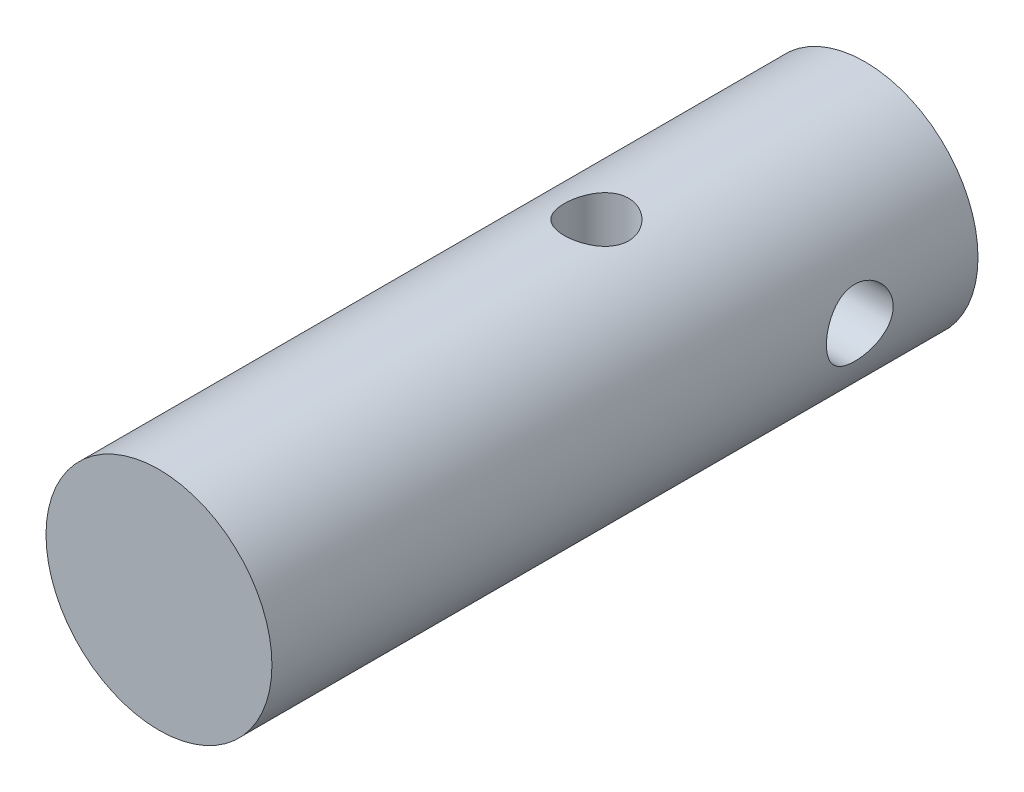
from build123d import *

# Parameters (mm, degrees)
BOSS_EXTRUDE1_DEPTH      = 25.4
BOSS_EXTRUDE1_DEPTH_BACK = 6.35
SKETCH1_R                = 5.08
CUT_EXTRUDE1_DEPTH       = 27.396454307
CUT_EXTRUDE1_DEPTH_BACK  = 27.396454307
SKETCH2_R                = 1.45
CUT_EXTRUDE2_DEPTH       = 28.824306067
CUT_EXTRUDE2_DEPTH_BACK  = 28.824306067
SKETCH3_R                = 1.5
SKETCH8_R                = 1.5
CUT_EXTRUDE5_DEPTH       = 5.08


with BuildPart() as part:
    # Sketch1 → Boss-Extrude1 (new, two sides: drawn at the far end of the back side and taken through both)
    with BuildSketch(Plane.XY.offset(-BOSS_EXTRUDE1_DEPTH_BACK)):
        Circle(SKETCH1_R)
    extrude(amount=BOSS_EXTRUDE1_DEPTH + BOSS_EXTRUDE1_DEPTH_BACK)

    # Sketch2 → Cut-Extrude1 (cut, two sides: drawn at the far end of the back side and taken through both)
    with BuildSketch(Plane(origin=(0, 0, 0), x_dir=(1, 0, 0), z_dir=(0, 1, 0)).offset(-CUT_EXTRUDE1_DEPTH_BACK)):
        with Locations(Location((0, -5.730036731, 0), (0, 0, 270))):
            Circle(SKETCH2_R)
    extrude(amount=CUT_EXTRUDE1_DEPTH + CUT_EXTRUDE1_DEPTH_BACK, mode=Mode.SUBTRACT)

    # Sketch3 → Cut-Extrude2 (cut, two sides: drawn at the far end of the back side and taken through both)
    with BuildSketch(Plane(origin=(5.08, 0, 0), x_dir=(0, 0, -1), z_dir=(1, 0, 0)).offset(-CUT_EXTRUDE2_DEPTH_BACK)):
        with Locations((1.034981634, 0)):
            Circle(SKETCH3_R)
    extrude(amount=CUT_EXTRUDE2_DEPTH + CUT_EXTRUDE2_DEPTH_BACK, mode=Mode.SUBTRACT)

    # Sketch8 → Cut-Extrude5 (cut)
    with BuildSketch(Plane(origin=(-5.08, 0, 0), x_dir=(0, 0, -1), z_dir=(1, 0, 0))):
        with Locations(Location((-22.86, 0, 0), (0, 0, 180))):
            Circle(SKETCH8_R)
    extrude(amount=CUT_EXTRUDE5_DEPTH, mode=Mode.SUBTRACT)


solid = part.part
